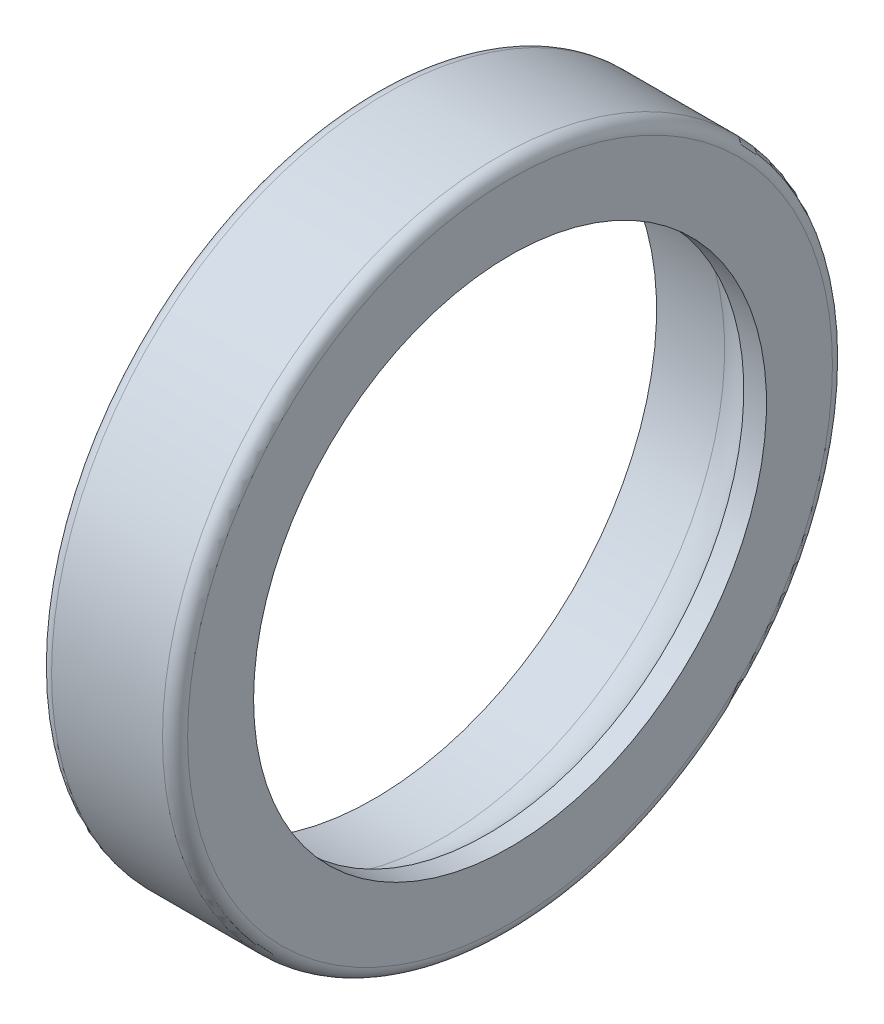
from build123d import *


with BuildPart() as part:
    # Esquisse1 → Base-R_volution (revolve)
    with BuildSketch(Plane(origin=(0, 0, 0), x_dir=(1, 0, 0), z_dir=(0, 1, 0)), mode=Mode.PRIVATE) as base_r_volution_sk:
        with BuildLine():
            Line((8.25, 12.25), (7.165063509, 12.25))
            ThreePointArc((7.165063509, 12.25), (6.25, 13.165063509), (5, 13.5))
            Line((5, 13.5), (1.75, 13.5))
            Line((1.75, 13.5), (1.75, 15.4))
            ThreePointArc((1.75, 15.4), (1.925735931, 15.824264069), (2.35, 16))
            Line((2.35, 16), (7.65, 16))
            ThreePointArc((7.65, 16), (8.074264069, 15.824264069), (8.25, 15.4))
            Line((8.25, 15.4), (8.25, 12.25))
        make_face()
    revolve(base_r_volution_sk.sketch.rotate(Axis((0, 0, 0), (1, 0, 0)), 180), axis=Axis((0, 0, 0), (1, 0, 0)))


solid = part.part
